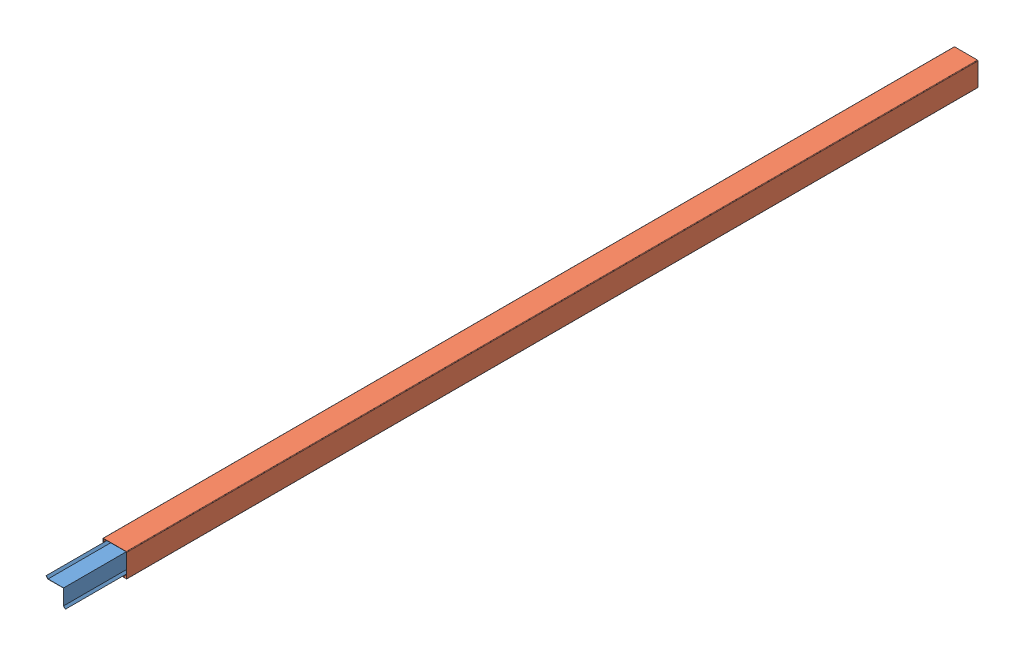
SolidWorks assembly M20C.SLDASM, configuration Default (file format 11000). Lengths in mm.
Overall size (55.56 55.56 2139.01).
2 component instances, 2 part files, 1 mates.
Components (placement in the parent):
- M20C-SUPPORT-1: M20C-SUPPORT.SLDPRT [Default] at origin size (45.85 45.85 2000)
- M20C CAP-1: M20C CAP.SLDPRT [Default] at (9.2873 8.6808 -139.0069) size (55.56 55.56 2000)
Mates (geometry in assembly coordinates):
- Parallel1: parallel: plane of M20C-SUPPORT-1 through (0 -36.5125 2000) normal (1 0 0); plane of M20C CAP-1 through (9.2873 -46.4696 1860.9931) normal (1 0 0)
